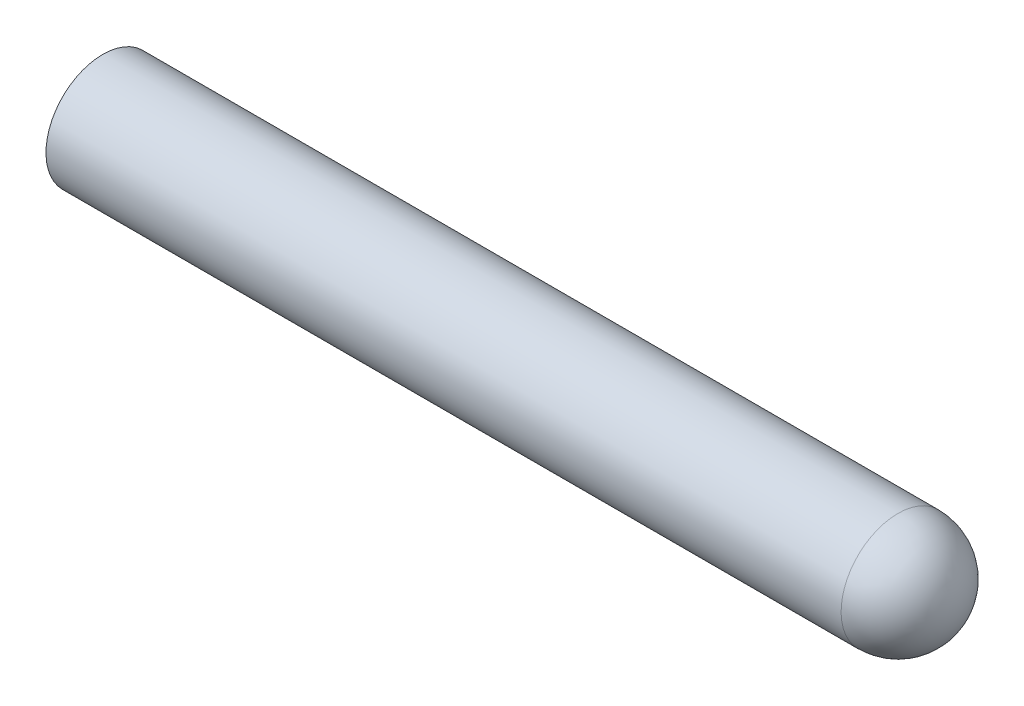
from build123d import *


with BuildPart() as part:
    # Sketch1 → Revolve1 (revolve)
    with BuildSketch(Plane.XY):
        with BuildLine():
            Line((0, 0), (140, 0))
            ThreePointArc((140, 0), (147.071067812, -2.928932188), (150, -10))
            Line((150, -10), (0, -10))
            Line((0, -10), (0, 0))
        make_face()
    revolve(axis=Axis((150, -10, 0), (-1, 0, 0)))


solid = part.part
